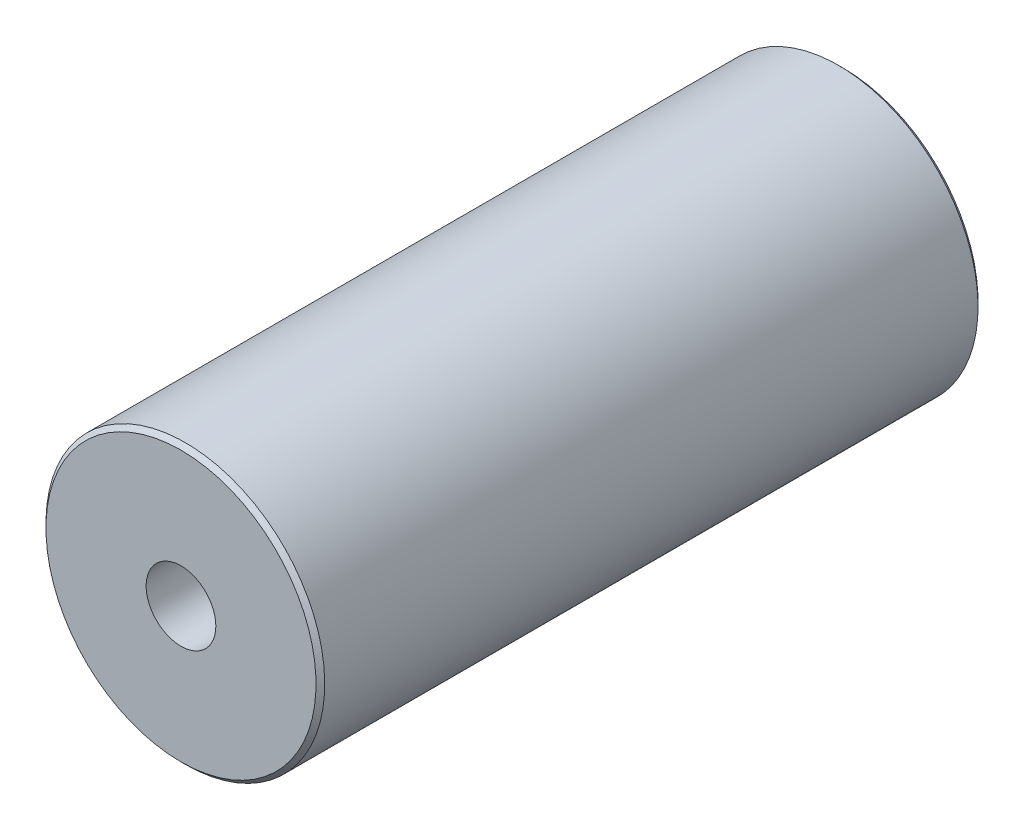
from build123d import *

# Parameters (mm, degrees)
M6_TAPPED_HOLE1_D           = 6.8
M6_TAPPED_HOLE1_DEPTH       = 18
M6_TAPPED_HOLE1_CBORE_D     = 8
M6_TAPPED_HOLE1_CBORE_DEPTH = 15
M6_TAPPED_HOLE1_TIP         = 1.962990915


with BuildPart() as part:
    # Sketch1 → Revolve1 (revolve)
    with BuildSketch(Plane(origin=(0, 0, 0), x_dir=(0, 0, -1), z_dir=(1, 0, 0)), mode=Mode.PRIVATE) as revolve1_sk:
        Polygon((0, 0), (0, 15.5), (0.5, 16), (75.5, 16), (76, 15.5), (76, 4.5), (75.5, 4), (61, 4), (58.690598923, 0), align=None)
    revolve(revolve1_sk.sketch.rotate(Axis((0, 0, 0), (0, 0, -1)), 180), axis=Axis((0, 0, 0), (0, 0, -1)))

    # M6 Tapped Hole1
    with Locations(Plane.XY):
        with Locations((0, 0)):
            CounterBoreHole(M6_TAPPED_HOLE1_D / 2, M6_TAPPED_HOLE1_CBORE_D / 2, M6_TAPPED_HOLE1_CBORE_DEPTH, depth=M6_TAPPED_HOLE1_DEPTH)
            with Locations((0, 0, -(M6_TAPPED_HOLE1_DEPTH + M6_TAPPED_HOLE1_TIP / 2))):  # 120° drill point
                Cone(0, M6_TAPPED_HOLE1_D / 2, M6_TAPPED_HOLE1_TIP, mode=Mode.SUBTRACT)


solid = part.part
